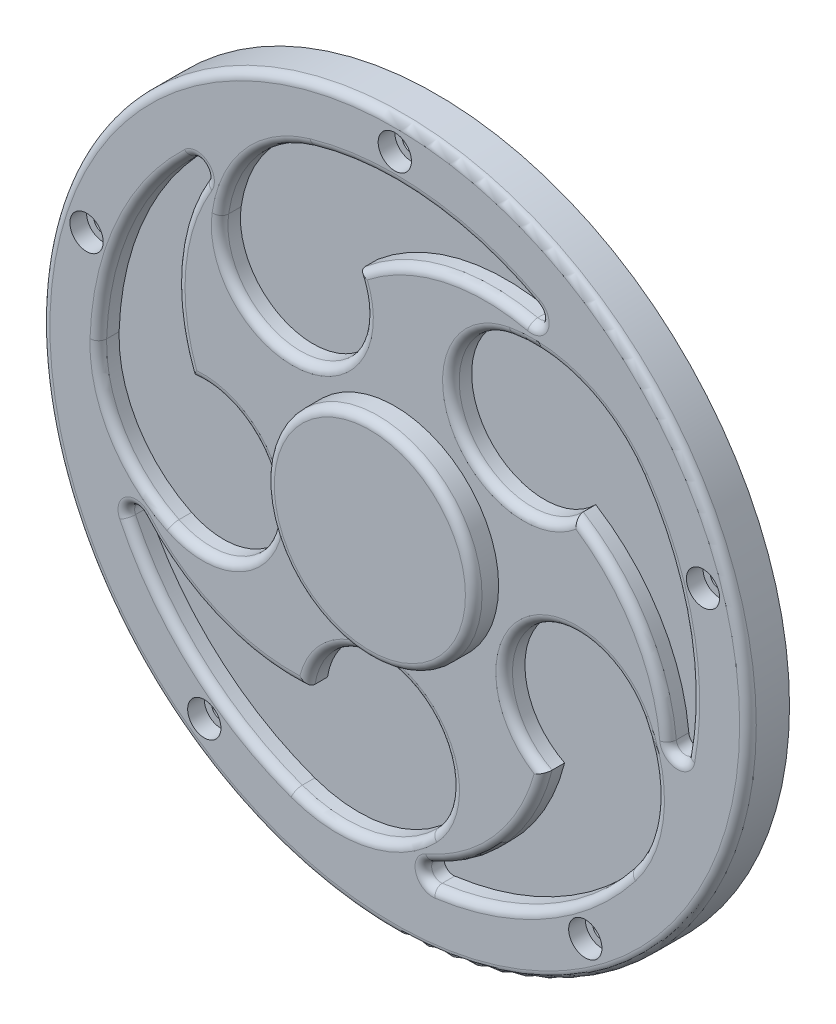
from build123d import *

# Parameters (mm, degrees)
SKETCH1_R                      = 85
BOSS_EXTRUDE1_DEPTH            = 10
SKETCH2_R                      = 25
BOSS_EXTRUDE2_DEPTH            = 6
FILLET1_R                      = 2
CUT_EXTRUDE1_DEPTH             = 5
FILLET3_R                      = 2
CIRPATTERN1_COUNT              = 5
FILLET3_OF_CIRPATTERN1_R       = 2
CBORE_FOR_M4_SHCS1_D           = 4.5
CBORE_FOR_M4_SHCS1_CBORE_D     = 8
CBORE_FOR_M4_SHCS1_CBORE_DEPTH = 4


with BuildPart() as part:
    # Sketch1 → Boss-Extrude1 (new body)
    with BuildSketch(Plane.XY):
        Circle(SKETCH1_R)
    extrude(amount=-BOSS_EXTRUDE1_DEPTH)

    # Sketch2 → Boss-Extrude2 (add)
    with BuildSketch(Plane.XY):
        Circle(SKETCH2_R)
    extrude(amount=BOSS_EXTRUDE2_DEPTH)

    # Fillet1
    fillet1_edges = [part.edges().sort_by_distance(p)[0] for p in [
        (-85, 0, 0),
        (-25, 0, 6),
    ]]
    fillet(fillet1_edges, radius=FILLET1_R)

    # Sketch3 → Cut-Extrude1 (cut)
    with BuildSketch(Plane.XY):
        with BuildLine():
            ThreePointArc((27.961156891, 53.234135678), (15.477310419, 27.919399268), (43.374368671, 23.625631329))
            ThreePointArc((43.374368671, 23.625631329), (58.826379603, 8.084372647), (65.759424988, -12.70572704))
            ThreePointArc((65.759424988, -12.70572704), (67.898523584, -14.74771051), (70.212922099, -12.90678715))
            ThreePointArc((70.212922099, -12.90678715), (69.864240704, 14.677447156), (59.083277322, 40.070012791))
            ThreePointArc((59.083277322, 40.070012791), (45.467385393, 51.25076738), (27.961156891, 53.234135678))
        make_face()
    cut_extrude1 = extrude(amount=-CUT_EXTRUDE1_DEPTH, mode=Mode.SUBTRACT)

    # Fillet3
    fillet3_edges = [part.edges().sort_by_distance(p)[0] for p in [
        (67.898523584, -14.74771051, 0),
        (69.864240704, 14.677447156, 0),
        (45.467385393, 51.25076738, 0),
        (15.477310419, 27.919399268, 0),
        (58.826379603, 8.084372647, 0),
    ]]
    fillet(fillet3_edges, radius=FILLET3_R)

    # CirPattern1: Cut-Extrude1 ×5 about axis
    cirpattern1_axis = Axis((0, 0, 0), (0, 0, 1))
    for i in range(1, CIRPATTERN1_COUNT):
        add(cut_extrude1.rotate(cirpattern1_axis, i * 360 / CIRPATTERN1_COUNT), mode=Mode.SUBTRACT)

    # Fillet3 of CirPattern1
    fillet3_of_cirpattern1_edges = [part.edges().sort_by_distance(p)[0] for p in [
        (35.007703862, 60.018040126, 0),
        (7.630155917, 70.980421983, 0),
        (-34.692181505, 59.079411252, 0),
        (-21.770174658, 23.347365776, 0),
        (10.489655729, 58.445420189, 0),
        (-46.26257273, 51.840899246, 0),
        (-65.148545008, 29.190866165, 0),
        (-66.908332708, -14.73768319, 0),
        (-28.932018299, -13.489933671, 0),
        (-52.343415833, 28.036883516, 0),
        (-63.599546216, -27.978602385, 0),
        (-47.894171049, -52.939474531, 0),
        (-6.659442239, -68.18780038, 0),
        (3.889203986, -31.684603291, 0),
        (-42.839665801, -41.117673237, 0),
        (6.9558915, -69.132626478, 0),
        (35.548319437, -61.909260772, 0),
        (62.792571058, -27.404695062, 0),
        (31.335678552, -6.092228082, 0),
        (25.867046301, -53.449003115, 0),
    ]]
    fillet(fillet3_of_cirpattern1_edges, radius=FILLET3_OF_CIRPATTERN1_R)

    # CBORE for M4 SHCS1 (through all)
    with Locations(Plane.XY):
        with Locations((-74.182408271, 24.103325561), (0, 78), (74.182408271, 24.103325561), (45.847249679, -63.103325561), (-45.847249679, -63.103325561)):
            CounterBoreHole(CBORE_FOR_M4_SHCS1_D / 2, CBORE_FOR_M4_SHCS1_CBORE_D / 2, CBORE_FOR_M4_SHCS1_CBORE_DEPTH)


solid = part.part
